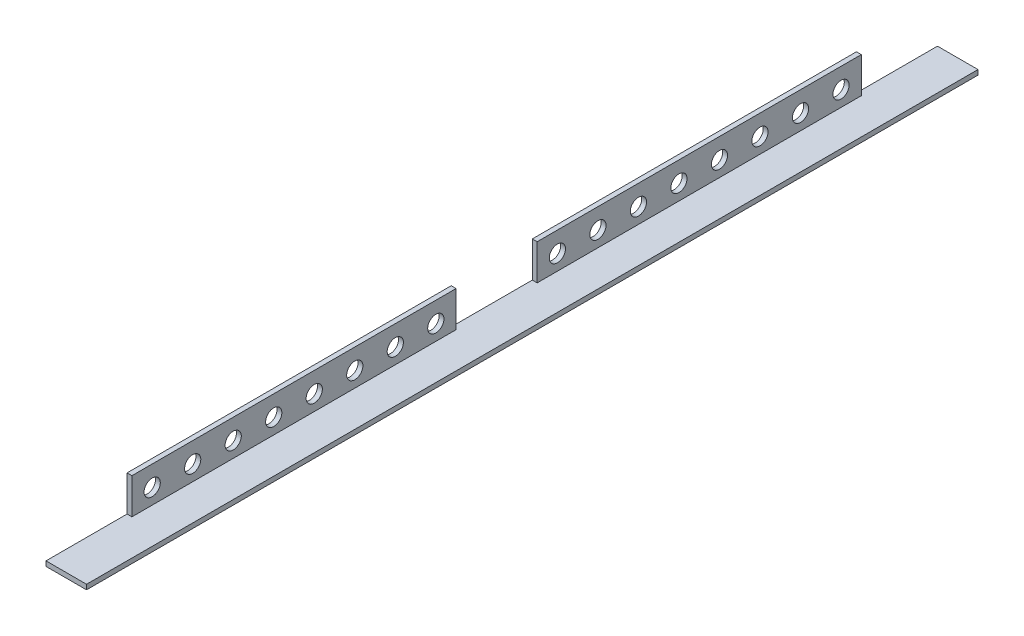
from build123d import *

# Parameters (mm, degrees)
BOSS_EXTRUDE1_DEPTH = 558.8
SKETCH2_W           = 50.8
SKETCH2_H           = 22.352
CUT_EXTRUDE1_DEPTH  = 558.8
SKETCH3_R           = 5.08
CUT_EXTRUDE2_DEPTH  = 89.916


with BuildPart() as part:
    # Sketch1 → Boss-Extrude1 (new body)
    with BuildSketch(Plane.XY):
        Polygon((-43.170695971, 0), (-43.170695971, -25.4), (-17.770695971, -25.4), (-17.770695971, -22.352), (-40.122695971, -22.352), (-40.122695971, 0), align=None)
    extrude(amount=BOSS_EXTRUDE1_DEPTH)

    # Sketch2 → Cut-Extrude1 (cut)
    with BuildSketch(Plane(origin=(-40.122695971, 0, 0), x_dir=(0, 0, -1), z_dir=(1, 0, 0))):
        with Locations((-533.4, -11.176)):
            Rectangle(SKETCH2_W, SKETCH2_H)
        with Locations((-279.4, -11.176)):
            Rectangle(SKETCH2_W, SKETCH2_H)
        with Locations((-25.4, -11.176)):
            Rectangle(SKETCH2_W, SKETCH2_H)
    extrude(amount=-CUT_EXTRUDE1_DEPTH, mode=Mode.SUBTRACT)

    # Sketch3 → Cut-Extrude2 (cut)
    with BuildSketch(Plane.ZY.offset(43.170695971)):
        with Locations((63.5, -12.7)):
            Circle(SKETCH3_R)
        with Locations((88.9, -12.7)):
            Circle(SKETCH3_R)
        with Locations((114.3, -12.7)):
            Circle(SKETCH3_R)
        with Locations((139.7, -12.7)):
            Circle(SKETCH3_R)
        with Locations((165.1, -12.7)):
            Circle(SKETCH3_R)
        with Locations((190.5, -12.7)):
            Circle(SKETCH3_R)
        with Locations((215.9, -12.7)):
            Circle(SKETCH3_R)
        with Locations((317.5, -12.7)):
            Circle(SKETCH3_R)
        with Locations((342.9, -12.7)):
            Circle(SKETCH3_R)
        with Locations((368.3, -12.7)):
            Circle(SKETCH3_R)
        with Locations((393.7, -12.7)):
            Circle(SKETCH3_R)
        with Locations((419.1, -12.7)):
            Circle(SKETCH3_R)
        with Locations((444.5, -12.7)):
            Circle(SKETCH3_R)
        with Locations((469.9, -12.7)):
            Circle(SKETCH3_R)
        with Locations((495.3, -12.7)):
            Circle(SKETCH3_R)
        with Locations((241.3, -12.7)):
            Circle(SKETCH3_R)
    extrude(amount=-CUT_EXTRUDE2_DEPTH, mode=Mode.SUBTRACT)


solid = part.part
